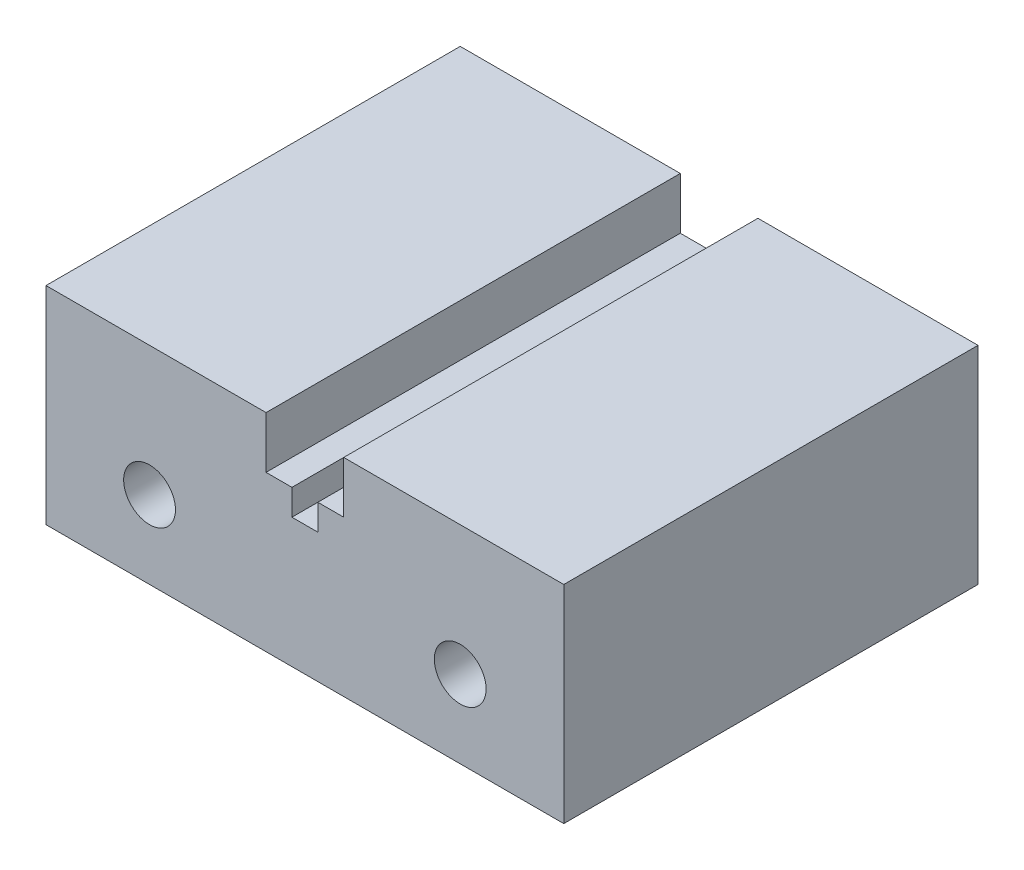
ISO-10303-21;
HEADER;
FILE_DESCRIPTION(('STEP AP214'),'2;1');
FILE_NAME('part.step','',(''),(''),'','','');
FILE_SCHEMA(('AUTOMOTIVE_DESIGN { 1 0 10303 214 1 1 1 1 }'));
ENDSEC;
DATA;
#1=APPLICATION_CONTEXT('core data for automotive mechanical design processes');
#2=APPLICATION_PROTOCOL_DEFINITION('international standard','automotive_design',2000,#1);
#3=PRODUCT_CONTEXT('',#1,'mechanical');
#4=PRODUCT('Part','Part','',(#3));
#5=PRODUCT_RELATED_PRODUCT_CATEGORY('part','',(#4));
#6=PRODUCT_DEFINITION_FORMATION('','',#4);
#7=PRODUCT_DEFINITION_CONTEXT('part definition',#1,'design');
#8=PRODUCT_DEFINITION('design','',#6,#7);
#9=PRODUCT_DEFINITION_SHAPE('','',#8);
#10=(LENGTH_UNIT() NAMED_UNIT(*) SI_UNIT(.MILLI.,.METRE.));
#11=(NAMED_UNIT(*) PLANE_ANGLE_UNIT() SI_UNIT($,.RADIAN.));
#12=(NAMED_UNIT(*) SI_UNIT($,.STERADIAN.) SOLID_ANGLE_UNIT());
#13=UNCERTAINTY_MEASURE_WITH_UNIT(LENGTH_MEASURE(1.E-05),#10,'distance_accuracy_value','');
#14=(GEOMETRIC_REPRESENTATION_CONTEXT(3) GLOBAL_UNCERTAINTY_ASSIGNED_CONTEXT((#13)) GLOBAL_UNIT_ASSIGNED_CONTEXT((#10,
#11,#12)) REPRESENTATION_CONTEXT('',''));
#15=CARTESIAN_POINT('',(0.,0.,0.));
#16=DIRECTION('',(0.,0.,1.));
#17=DIRECTION('',(1.,0.,0.));
#18=AXIS2_PLACEMENT_3D('',#15,#16,#17);
#19=CARTESIAN_POINT('',(0.,0.,80.));
#20=DIRECTION('',(0.,0.,-1.));
#21=DIRECTION('',(-1.,0.,0.));
#22=AXIS2_PLACEMENT_3D('',#19,#20,#21);
#23=PLANE('',#22);
#24=DIRECTION('',(0.,-1.,0.));
#25=VECTOR('',#24,1.);
#26=CARTESIAN_POINT('',(0.,0.,80.));
#27=LINE('',#26,#25);
#28=CARTESIAN_POINT('',(0.,40.,80.));
#29=VERTEX_POINT('',#28);
#30=CARTESIAN_POINT('',(0.,0.,80.));
#31=VERTEX_POINT('',#30);
#32=EDGE_CURVE('E177',#29,#31,#27,.T.);
#33=ORIENTED_EDGE('',*,*,#32,.T.);
#34=DIRECTION('',(1.,0.,0.));
#35=VECTOR('',#34,1.);
#36=CARTESIAN_POINT('',(0.,0.,80.));
#37=LINE('',#36,#35);
#38=CARTESIAN_POINT('',(100.,0.,80.));
#39=VERTEX_POINT('',#38);
#40=EDGE_CURVE('E105',#31,#39,#37,.T.);
#41=ORIENTED_EDGE('',*,*,#40,.T.);
#42=DIRECTION('',(0.,1.,0.));
#43=VECTOR('',#42,1.);
#44=CARTESIAN_POINT('',(100.,0.,80.));
#45=LINE('',#44,#43);
#46=CARTESIAN_POINT('',(100.,40.,80.));
#47=VERTEX_POINT('',#46);
#48=EDGE_CURVE('E204',#39,#47,#45,.T.);
#49=ORIENTED_EDGE('',*,*,#48,.T.);
#50=DIRECTION('',(-1.,0.,0.));
#51=VECTOR('',#50,1.);
#52=CARTESIAN_POINT('',(57.5,40.,80.));
#53=LINE('',#52,#51);
#54=CARTESIAN_POINT('',(57.5,40.,80.));
#55=VERTEX_POINT('',#54);
#56=EDGE_CURVE('E223',#47,#55,#53,.T.);
#57=ORIENTED_EDGE('',*,*,#56,.T.);
#58=DIRECTION('',(0.,-1.,0.));
#59=VECTOR('',#58,1.);
#60=CARTESIAN_POINT('',(57.5,30.,80.));
#61=LINE('',#60,#59);
#62=CARTESIAN_POINT('',(57.5,30.,80.));
#63=VERTEX_POINT('',#62);
#64=EDGE_CURVE('E220',#55,#63,#61,.T.);
#65=ORIENTED_EDGE('',*,*,#64,.T.);
#66=DIRECTION('',(-1.,0.,0.));
#67=VECTOR('',#66,1.);
#68=CARTESIAN_POINT('',(52.5,30.,80.));
#69=LINE('',#68,#67);
#70=CARTESIAN_POINT('',(52.5,30.,80.));
#71=VERTEX_POINT('',#70);
#72=EDGE_CURVE('E222',#63,#71,#69,.T.);
#73=ORIENTED_EDGE('',*,*,#72,.T.);
#74=DIRECTION('',(0.,-1.,0.));
#75=VECTOR('',#74,1.);
#76=CARTESIAN_POINT('',(52.5,25.,80.));
#77=LINE('',#76,#75);
#78=CARTESIAN_POINT('',(52.5,25.,80.));
#79=VERTEX_POINT('',#78);
#80=EDGE_CURVE('E225',#71,#79,#77,.T.);
#81=ORIENTED_EDGE('',*,*,#80,.T.);
#82=DIRECTION('',(-1.,0.,0.));
#83=VECTOR('',#82,1.);
#84=CARTESIAN_POINT('',(47.5,25.,80.));
#85=LINE('',#84,#83);
#86=CARTESIAN_POINT('',(47.5,25.,80.));
#87=VERTEX_POINT('',#86);
#88=EDGE_CURVE('E231',#79,#87,#85,.T.);
#89=ORIENTED_EDGE('',*,*,#88,.T.);
#90=DIRECTION('',(0.,1.,0.));
#91=VECTOR('',#90,1.);
#92=CARTESIAN_POINT('',(47.5,30.,80.));
#93=LINE('',#92,#91);
#94=CARTESIAN_POINT('',(47.5,30.,80.));
#95=VERTEX_POINT('',#94);
#96=EDGE_CURVE('E136',#87,#95,#93,.T.);
#97=ORIENTED_EDGE('',*,*,#96,.T.);
#98=DIRECTION('',(-1.,0.,0.));
#99=VECTOR('',#98,1.);
#100=CARTESIAN_POINT('',(42.5,30.,80.));
#101=LINE('',#100,#99);
#102=CARTESIAN_POINT('',(42.5,30.,80.));
#103=VERTEX_POINT('',#102);
#104=EDGE_CURVE('E130',#95,#103,#101,.T.);
#105=ORIENTED_EDGE('',*,*,#104,.T.);
#106=DIRECTION('',(0.,1.,0.));
#107=VECTOR('',#106,1.);
#108=CARTESIAN_POINT('',(42.5,40.,80.));
#109=LINE('',#108,#107);
#110=CARTESIAN_POINT('',(42.5,40.,80.));
#111=VERTEX_POINT('',#110);
#112=EDGE_CURVE('E134',#103,#111,#109,.T.);
#113=ORIENTED_EDGE('',*,*,#112,.T.);
#114=DIRECTION('',(-1.,0.,0.));
#115=VECTOR('',#114,1.);
#116=CARTESIAN_POINT('',(0.,40.,80.));
#117=LINE('',#116,#115);
#118=EDGE_CURVE('E50',#111,#29,#117,.T.);
#119=ORIENTED_EDGE('',*,*,#118,.T.);
#120=EDGE_LOOP('',(#33,#41,#49,#57,#65,#73,#81,#89,#97,#105,#113,#119));
#121=FACE_BOUND('',#120,.T.);
#122=CARTESIAN_POINT('',(20.,15.,80.));
#123=DIRECTION('',(0.,0.,1.));
#124=DIRECTION('',(1.,0.,0.));
#125=AXIS2_PLACEMENT_3D('',#122,#123,#124);
#126=CIRCLE('',#125,5.);
#127=CARTESIAN_POINT('',(25.,15.,80.));
#128=VERTEX_POINT('',#127);
#129=EDGE_CURVE('E158',#128,#128,#126,.T.);
#130=ORIENTED_EDGE('',*,*,#129,.F.);
#131=EDGE_LOOP('',(#130));
#132=FACE_BOUND('',#131,.T.);
#133=CARTESIAN_POINT('',(80.,15.,80.));
#134=DIRECTION('',(0.,0.,1.));
#135=DIRECTION('',(1.,0.,0.));
#136=AXIS2_PLACEMENT_3D('',#133,#134,#135);
#137=CIRCLE('',#136,5.);
#138=CARTESIAN_POINT('',(85.,15.,80.));
#139=VERTEX_POINT('',#138);
#140=EDGE_CURVE('E272',#139,#139,#137,.T.);
#141=ORIENTED_EDGE('',*,*,#140,.F.);
#142=EDGE_LOOP('',(#141));
#143=FACE_BOUND('',#142,.T.);
#144=ADVANCED_FACE('F33',(#121,#132,#143),#23,.F.);
#145=CARTESIAN_POINT('',(0.,0.,0.));
#146=DIRECTION('',(0.,0.,-1.));
#147=DIRECTION('',(-1.,0.,0.));
#148=AXIS2_PLACEMENT_3D('',#145,#146,#147);
#149=PLANE('',#148);
#150=CARTESIAN_POINT('',(20.,15.,0.));
#151=DIRECTION('',(0.,0.,1.));
#152=DIRECTION('',(1.,0.,0.));
#153=AXIS2_PLACEMENT_3D('',#150,#151,#152);
#154=CIRCLE('',#153,5.);
#155=CARTESIAN_POINT('',(25.,15.,0.));
#156=VERTEX_POINT('',#155);
#157=EDGE_CURVE('E277',#156,#156,#154,.T.);
#158=ORIENTED_EDGE('',*,*,#157,.T.);
#159=EDGE_LOOP('',(#158));
#160=FACE_BOUND('',#159,.T.);
#161=DIRECTION('',(0.,-1.,0.));
#162=VECTOR('',#161,1.);
#163=CARTESIAN_POINT('',(0.,0.,0.));
#164=LINE('',#163,#162);
#165=CARTESIAN_POINT('',(0.,40.,0.));
#166=VERTEX_POINT('',#165);
#167=CARTESIAN_POINT('',(0.,0.,0.));
#168=VERTEX_POINT('',#167);
#169=EDGE_CURVE('E154',#166,#168,#164,.T.);
#170=ORIENTED_EDGE('',*,*,#169,.F.);
#171=DIRECTION('',(-1.,0.,0.));
#172=VECTOR('',#171,1.);
#173=CARTESIAN_POINT('',(0.,40.,0.));
#174=LINE('',#173,#172);
#175=CARTESIAN_POINT('',(42.5,40.,0.));
#176=VERTEX_POINT('',#175);
#177=EDGE_CURVE('E97',#176,#166,#174,.T.);
#178=ORIENTED_EDGE('',*,*,#177,.F.);
#179=DIRECTION('',(0.,1.,0.));
#180=VECTOR('',#179,1.);
#181=CARTESIAN_POINT('',(42.5,40.,0.));
#182=LINE('',#181,#180);
#183=CARTESIAN_POINT('',(42.5,30.,0.));
#184=VERTEX_POINT('',#183);
#185=EDGE_CURVE('E91',#184,#176,#182,.T.);
#186=ORIENTED_EDGE('',*,*,#185,.F.);
#187=DIRECTION('',(-1.,0.,0.));
#188=VECTOR('',#187,1.);
#189=CARTESIAN_POINT('',(42.5,30.,0.));
#190=LINE('',#189,#188);
#191=CARTESIAN_POINT('',(47.5,30.,0.));
#192=VERTEX_POINT('',#191);
#193=EDGE_CURVE('E144',#192,#184,#190,.T.);
#194=ORIENTED_EDGE('',*,*,#193,.F.);
#195=DIRECTION('',(0.,1.,0.));
#196=VECTOR('',#195,1.);
#197=CARTESIAN_POINT('',(47.5,30.,0.));
#198=LINE('',#197,#196);
#199=CARTESIAN_POINT('',(47.5,25.,0.));
#200=VERTEX_POINT('',#199);
#201=EDGE_CURVE('E172',#200,#192,#198,.T.);
#202=ORIENTED_EDGE('',*,*,#201,.F.);
#203=DIRECTION('',(-1.,0.,0.));
#204=VECTOR('',#203,1.);
#205=CARTESIAN_POINT('',(47.5,25.,0.));
#206=LINE('',#205,#204);
#207=CARTESIAN_POINT('',(52.5,25.,0.));
#208=VERTEX_POINT('',#207);
#209=EDGE_CURVE('E170',#208,#200,#206,.T.);
#210=ORIENTED_EDGE('',*,*,#209,.F.);
#211=DIRECTION('',(0.,-1.,0.));
#212=VECTOR('',#211,1.);
#213=CARTESIAN_POINT('',(52.5,25.,0.));
#214=LINE('',#213,#212);
#215=CARTESIAN_POINT('',(52.5,30.,0.));
#216=VERTEX_POINT('',#215);
#217=EDGE_CURVE('E168',#216,#208,#214,.T.);
#218=ORIENTED_EDGE('',*,*,#217,.F.);
#219=DIRECTION('',(-1.,0.,0.));
#220=VECTOR('',#219,1.);
#221=CARTESIAN_POINT('',(52.5,30.,0.));
#222=LINE('',#221,#220);
#223=CARTESIAN_POINT('',(57.5,30.,0.));
#224=VERTEX_POINT('',#223);
#225=EDGE_CURVE('E166',#224,#216,#222,.T.);
#226=ORIENTED_EDGE('',*,*,#225,.F.);
#227=DIRECTION('',(0.,-1.,0.));
#228=VECTOR('',#227,1.);
#229=CARTESIAN_POINT('',(57.5,30.,0.));
#230=LINE('',#229,#228);
#231=CARTESIAN_POINT('',(57.5,40.,0.));
#232=VERTEX_POINT('',#231);
#233=EDGE_CURVE('E164',#232,#224,#230,.T.);
#234=ORIENTED_EDGE('',*,*,#233,.F.);
#235=DIRECTION('',(-1.,0.,0.));
#236=VECTOR('',#235,1.);
#237=CARTESIAN_POINT('',(57.5,40.,0.));
#238=LINE('',#237,#236);
#239=CARTESIAN_POINT('',(100.,40.,0.));
#240=VERTEX_POINT('',#239);
#241=EDGE_CURVE('E162',#240,#232,#238,.T.);
#242=ORIENTED_EDGE('',*,*,#241,.F.);
#243=DIRECTION('',(0.,1.,0.));
#244=VECTOR('',#243,1.);
#245=CARTESIAN_POINT('',(100.,0.,0.));
#246=LINE('',#245,#244);
#247=CARTESIAN_POINT('',(100.,0.,0.));
#248=VERTEX_POINT('',#247);
#249=EDGE_CURVE('E160',#248,#240,#246,.T.);
#250=ORIENTED_EDGE('',*,*,#249,.F.);
#251=DIRECTION('',(1.,0.,0.));
#252=VECTOR('',#251,1.);
#253=CARTESIAN_POINT('',(0.,0.,0.));
#254=LINE('',#253,#252);
#255=EDGE_CURVE('E157',#168,#248,#254,.T.);
#256=ORIENTED_EDGE('',*,*,#255,.F.);
#257=EDGE_LOOP('',(#170,#178,#186,#194,#202,#210,#218,#226,#234,#242,#250,#256));
#258=FACE_BOUND('',#257,.T.);
#259=CARTESIAN_POINT('',(80.,15.,0.));
#260=DIRECTION('',(0.,0.,1.));
#261=DIRECTION('',(1.,0.,0.));
#262=AXIS2_PLACEMENT_3D('',#259,#260,#261);
#263=CIRCLE('',#262,5.);
#264=CARTESIAN_POINT('',(85.,15.,0.));
#265=VERTEX_POINT('',#264);
#266=EDGE_CURVE('E275',#265,#265,#263,.T.);
#267=ORIENTED_EDGE('',*,*,#266,.T.);
#268=EDGE_LOOP('',(#267));
#269=FACE_BOUND('',#268,.T.);
#270=ADVANCED_FACE('F208',(#160,#258,#269),#149,.T.);
#271=CARTESIAN_POINT('',(0.,0.,80.));
#272=DIRECTION('',(1.,0.,0.));
#273=DIRECTION('',(0.,0.,-1.));
#274=AXIS2_PLACEMENT_3D('',#271,#272,#273);
#275=PLANE('',#274);
#276=ORIENTED_EDGE('',*,*,#169,.T.);
#277=DIRECTION('',(0.,0.,-1.));
#278=VECTOR('',#277,1.);
#279=CARTESIAN_POINT('',(0.,0.,80.));
#280=LINE('',#279,#278);
#281=EDGE_CURVE('E11',#31,#168,#280,.T.);
#282=ORIENTED_EDGE('',*,*,#281,.F.);
#283=ORIENTED_EDGE('',*,*,#32,.F.);
#284=DIRECTION('',(0.,0.,-1.));
#285=VECTOR('',#284,1.);
#286=CARTESIAN_POINT('',(0.,40.,80.));
#287=LINE('',#286,#285);
#288=EDGE_CURVE('E150',#29,#166,#287,.T.);
#289=ORIENTED_EDGE('',*,*,#288,.T.);
#290=EDGE_LOOP('',(#276,#282,#283,#289));
#291=FACE_BOUND('',#290,.T.);
#292=ADVANCED_FACE('F35',(#291),#275,.F.);
#293=CARTESIAN_POINT('',(0.,0.,80.));
#294=DIRECTION('',(0.,1.,0.));
#295=DIRECTION('',(0.,0.,1.));
#296=AXIS2_PLACEMENT_3D('',#293,#294,#295);
#297=PLANE('',#296);
#298=ORIENTED_EDGE('',*,*,#255,.T.);
#299=DIRECTION('',(0.,0.,-1.));
#300=VECTOR('',#299,1.);
#301=CARTESIAN_POINT('',(100.,0.,80.));
#302=LINE('',#301,#300);
#303=EDGE_CURVE('E42',#39,#248,#302,.T.);
#304=ORIENTED_EDGE('',*,*,#303,.F.);
#305=ORIENTED_EDGE('',*,*,#40,.F.);
#306=ORIENTED_EDGE('',*,*,#281,.T.);
#307=EDGE_LOOP('',(#298,#304,#305,#306));
#308=FACE_BOUND('',#307,.T.);
#309=ADVANCED_FACE('F372',(#308),#297,.F.);
#310=CARTESIAN_POINT('',(100.,0.,80.));
#311=DIRECTION('',(-1.,0.,0.));
#312=DIRECTION('',(0.,0.,1.));
#313=AXIS2_PLACEMENT_3D('',#310,#311,#312);
#314=PLANE('',#313);
#315=ORIENTED_EDGE('',*,*,#249,.T.);
#316=DIRECTION('',(0.,0.,-1.));
#317=VECTOR('',#316,1.);
#318=CARTESIAN_POINT('',(100.,40.,80.));
#319=LINE('',#318,#317);
#320=EDGE_CURVE('E196',#47,#240,#319,.T.);
#321=ORIENTED_EDGE('',*,*,#320,.F.);
#322=ORIENTED_EDGE('',*,*,#48,.F.);
#323=ORIENTED_EDGE('',*,*,#303,.T.);
#324=EDGE_LOOP('',(#315,#321,#322,#323));
#325=FACE_BOUND('',#324,.T.);
#326=ADVANCED_FACE('F202',(#325),#314,.F.);
#327=CARTESIAN_POINT('',(57.5,40.,80.));
#328=DIRECTION('',(0.,-1.,0.));
#329=DIRECTION('',(0.,0.,-1.));
#330=AXIS2_PLACEMENT_3D('',#327,#328,#329);
#331=PLANE('',#330);
#332=ORIENTED_EDGE('',*,*,#241,.T.);
#333=DIRECTION('',(0.,0.,-1.));
#334=VECTOR('',#333,1.);
#335=CARTESIAN_POINT('',(57.5,40.,80.));
#336=LINE('',#335,#334);
#337=EDGE_CURVE('E193',#55,#232,#336,.T.);
#338=ORIENTED_EDGE('',*,*,#337,.F.);
#339=ORIENTED_EDGE('',*,*,#56,.F.);
#340=ORIENTED_EDGE('',*,*,#320,.T.);
#341=EDGE_LOOP('',(#332,#338,#339,#340));
#342=FACE_BOUND('',#341,.T.);
#343=ADVANCED_FACE('F214',(#342),#331,.F.);
#344=CARTESIAN_POINT('',(57.5,30.,80.));
#345=DIRECTION('',(1.,0.,0.));
#346=DIRECTION('',(0.,0.,-1.));
#347=AXIS2_PLACEMENT_3D('',#344,#345,#346);
#348=PLANE('',#347);
#349=ORIENTED_EDGE('',*,*,#233,.T.);
#350=DIRECTION('',(0.,0.,-1.));
#351=VECTOR('',#350,1.);
#352=CARTESIAN_POINT('',(57.5,30.,80.));
#353=LINE('',#352,#351);
#354=EDGE_CURVE('E190',#63,#224,#353,.T.);
#355=ORIENTED_EDGE('',*,*,#354,.F.);
#356=ORIENTED_EDGE('',*,*,#64,.F.);
#357=ORIENTED_EDGE('',*,*,#337,.T.);
#358=EDGE_LOOP('',(#349,#355,#356,#357));
#359=FACE_BOUND('',#358,.T.);
#360=ADVANCED_FACE('F218',(#359),#348,.F.);
#361=CARTESIAN_POINT('',(52.5,30.,80.));
#362=DIRECTION('',(0.,-1.,0.));
#363=DIRECTION('',(0.,0.,-1.));
#364=AXIS2_PLACEMENT_3D('',#361,#362,#363);
#365=PLANE('',#364);
#366=ORIENTED_EDGE('',*,*,#225,.T.);
#367=DIRECTION('',(0.,0.,-1.));
#368=VECTOR('',#367,1.);
#369=CARTESIAN_POINT('',(52.5,30.,80.));
#370=LINE('',#369,#368);
#371=EDGE_CURVE('E187',#71,#216,#370,.T.);
#372=ORIENTED_EDGE('',*,*,#371,.F.);
#373=ORIENTED_EDGE('',*,*,#72,.F.);
#374=ORIENTED_EDGE('',*,*,#354,.T.);
#375=EDGE_LOOP('',(#366,#372,#373,#374));
#376=FACE_BOUND('',#375,.T.);
#377=ADVANCED_FACE('F337',(#376),#365,.F.);
#378=CARTESIAN_POINT('',(52.5,25.,80.));
#379=DIRECTION('',(1.,0.,0.));
#380=DIRECTION('',(0.,0.,-1.));
#381=AXIS2_PLACEMENT_3D('',#378,#379,#380);
#382=PLANE('',#381);
#383=ORIENTED_EDGE('',*,*,#217,.T.);
#384=DIRECTION('',(0.,0.,-1.));
#385=VECTOR('',#384,1.);
#386=CARTESIAN_POINT('',(52.5,25.,80.));
#387=LINE('',#386,#385);
#388=EDGE_CURVE('E184',#79,#208,#387,.T.);
#389=ORIENTED_EDGE('',*,*,#388,.F.);
#390=ORIENTED_EDGE('',*,*,#80,.F.);
#391=ORIENTED_EDGE('',*,*,#371,.T.);
#392=EDGE_LOOP('',(#383,#389,#390,#391));
#393=FACE_BOUND('',#392,.T.);
#394=ADVANCED_FACE('F328',(#393),#382,.F.);
#395=CARTESIAN_POINT('',(47.5,25.,80.));
#396=DIRECTION('',(0.,-1.,0.));
#397=DIRECTION('',(0.,0.,-1.));
#398=AXIS2_PLACEMENT_3D('',#395,#396,#397);
#399=PLANE('',#398);
#400=ORIENTED_EDGE('',*,*,#209,.T.);
#401=DIRECTION('',(0.,0.,-1.));
#402=VECTOR('',#401,1.);
#403=CARTESIAN_POINT('',(47.5,25.,80.));
#404=LINE('',#403,#402);
#405=EDGE_CURVE('E181',#87,#200,#404,.T.);
#406=ORIENTED_EDGE('',*,*,#405,.F.);
#407=ORIENTED_EDGE('',*,*,#88,.F.);
#408=ORIENTED_EDGE('',*,*,#388,.T.);
#409=EDGE_LOOP('',(#400,#406,#407,#408));
#410=FACE_BOUND('',#409,.T.);
#411=ADVANCED_FACE('F237',(#410),#399,.F.);
#412=CARTESIAN_POINT('',(47.5,30.,80.));
#413=DIRECTION('',(-1.,0.,0.));
#414=DIRECTION('',(0.,0.,1.));
#415=AXIS2_PLACEMENT_3D('',#412,#413,#414);
#416=PLANE('',#415);
#417=ORIENTED_EDGE('',*,*,#201,.T.);
#418=DIRECTION('',(0.,0.,-1.));
#419=VECTOR('',#418,1.);
#420=CARTESIAN_POINT('',(47.5,30.,80.));
#421=LINE('',#420,#419);
#422=EDGE_CURVE('E145',#95,#192,#421,.T.);
#423=ORIENTED_EDGE('',*,*,#422,.F.);
#424=ORIENTED_EDGE('',*,*,#96,.F.);
#425=ORIENTED_EDGE('',*,*,#405,.T.);
#426=EDGE_LOOP('',(#417,#423,#424,#425));
#427=FACE_BOUND('',#426,.T.);
#428=ADVANCED_FACE('F241',(#427),#416,.F.);
#429=CARTESIAN_POINT('',(42.5,30.,80.));
#430=DIRECTION('',(0.,-1.,0.));
#431=DIRECTION('',(0.,0.,-1.));
#432=AXIS2_PLACEMENT_3D('',#429,#430,#431);
#433=PLANE('',#432);
#434=ORIENTED_EDGE('',*,*,#193,.T.);
#435=DIRECTION('',(0.,0.,-1.));
#436=VECTOR('',#435,1.);
#437=CARTESIAN_POINT('',(42.5,30.,80.));
#438=LINE('',#437,#436);
#439=EDGE_CURVE('E141',#103,#184,#438,.T.);
#440=ORIENTED_EDGE('',*,*,#439,.F.);
#441=ORIENTED_EDGE('',*,*,#104,.F.);
#442=ORIENTED_EDGE('',*,*,#422,.T.);
#443=EDGE_LOOP('',(#434,#440,#441,#442));
#444=FACE_BOUND('',#443,.T.);
#445=ADVANCED_FACE('F142',(#444),#433,.F.);
#446=CARTESIAN_POINT('',(42.5,40.,80.));
#447=DIRECTION('',(-1.,0.,0.));
#448=DIRECTION('',(0.,0.,1.));
#449=AXIS2_PLACEMENT_3D('',#446,#447,#448);
#450=PLANE('',#449);
#451=ORIENTED_EDGE('',*,*,#185,.T.);
#452=DIRECTION('',(0.,0.,-1.));
#453=VECTOR('',#452,1.);
#454=CARTESIAN_POINT('',(42.5,40.,80.));
#455=LINE('',#454,#453);
#456=EDGE_CURVE('E146',#111,#176,#455,.T.);
#457=ORIENTED_EDGE('',*,*,#456,.F.);
#458=ORIENTED_EDGE('',*,*,#112,.F.);
#459=ORIENTED_EDGE('',*,*,#439,.T.);
#460=EDGE_LOOP('',(#451,#457,#458,#459));
#461=FACE_BOUND('',#460,.T.);
#462=ADVANCED_FACE('F148',(#461),#450,.F.);
#463=CARTESIAN_POINT('',(0.,40.,80.));
#464=DIRECTION('',(0.,-1.,0.));
#465=DIRECTION('',(0.,0.,-1.));
#466=AXIS2_PLACEMENT_3D('',#463,#464,#465);
#467=PLANE('',#466);
#468=ORIENTED_EDGE('',*,*,#177,.T.);
#469=ORIENTED_EDGE('',*,*,#288,.F.);
#470=ORIENTED_EDGE('',*,*,#118,.F.);
#471=ORIENTED_EDGE('',*,*,#456,.T.);
#472=EDGE_LOOP('',(#468,#469,#470,#471));
#473=FACE_BOUND('',#472,.T.);
#474=ADVANCED_FACE('F245',(#473),#467,.F.);
#475=CARTESIAN_POINT('',(20.,15.,80.));
#476=DIRECTION('',(0.,0.,-1.));
#477=DIRECTION('',(-1.,0.,0.));
#478=AXIS2_PLACEMENT_3D('',#475,#476,#477);
#479=CYLINDRICAL_SURFACE('',#478,5.);
#480=ORIENTED_EDGE('',*,*,#129,.T.);
#481=EDGE_LOOP('',(#480));
#482=FACE_BOUND('',#481,.T.);
#483=ORIENTED_EDGE('',*,*,#157,.F.);
#484=EDGE_LOOP('',(#483));
#485=FACE_BOUND('',#484,.T.);
#486=ADVANCED_FACE('F247',(#482,#485),#479,.F.);
#487=CARTESIAN_POINT('',(80.,15.,80.));
#488=DIRECTION('',(0.,0.,-1.));
#489=DIRECTION('',(-1.,0.,0.));
#490=AXIS2_PLACEMENT_3D('',#487,#488,#489);
#491=CYLINDRICAL_SURFACE('',#490,5.);
#492=ORIENTED_EDGE('',*,*,#140,.T.);
#493=EDGE_LOOP('',(#492));
#494=FACE_BOUND('',#493,.T.);
#495=ORIENTED_EDGE('',*,*,#266,.F.);
#496=EDGE_LOOP('',(#495));
#497=FACE_BOUND('',#496,.T.);
#498=ADVANCED_FACE('F253',(#494,#497),#491,.F.);
#499=CLOSED_SHELL('',(#144,#270,#292,#309,#326,#343,#360,#377,#394,#411,#428,#445,#462,#474,
#486,#498));
#500=MANIFOLD_SOLID_BREP('B2',#499);
#501=ADVANCED_BREP_SHAPE_REPRESENTATION('',(#18,#500),#14);
#502=SHAPE_DEFINITION_REPRESENTATION(#9,#501);
ENDSEC;
END-ISO-10303-21;
